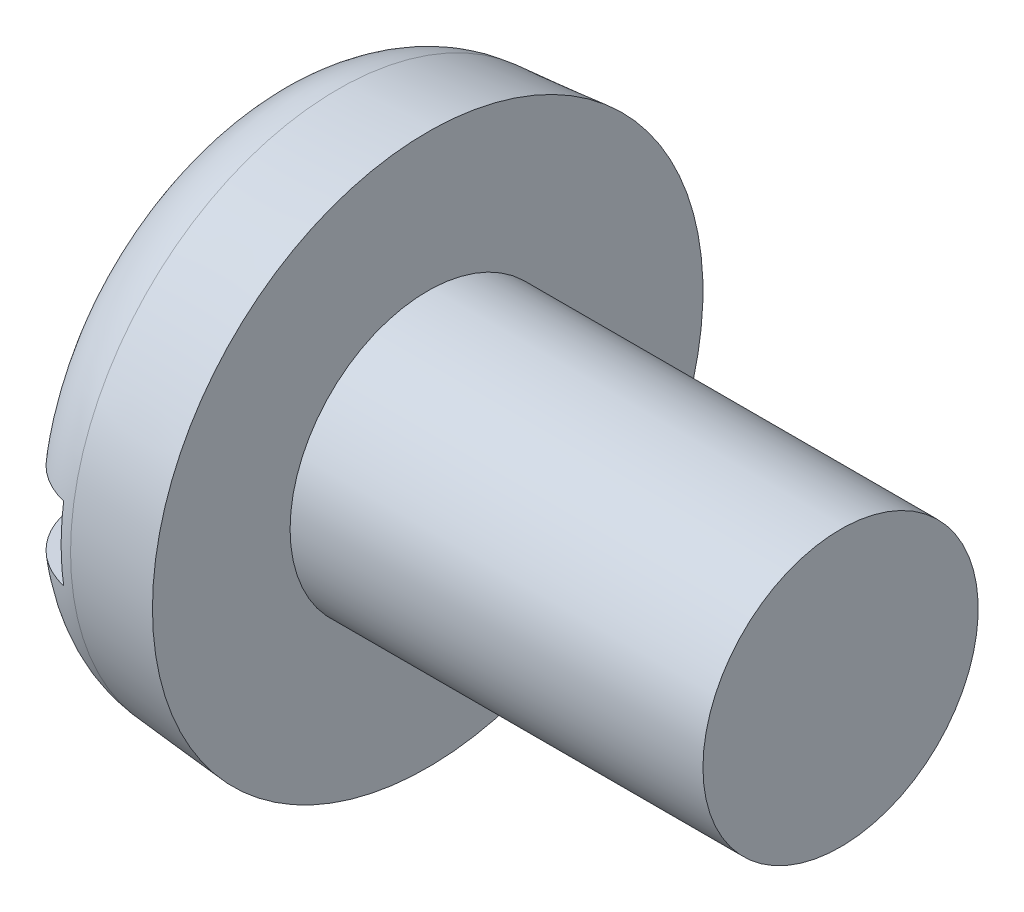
ISO-10303-21;
HEADER;
FILE_DESCRIPTION(('STEP AP214'),'2;1');
FILE_NAME('part.step','',(''),(''),'','','');
FILE_SCHEMA(('AUTOMOTIVE_DESIGN { 1 0 10303 214 1 1 1 1 }'));
ENDSEC;
DATA;
#1=APPLICATION_CONTEXT('core data for automotive mechanical design processes');
#2=APPLICATION_PROTOCOL_DEFINITION('international standard','automotive_design',2000,#1);
#3=PRODUCT_CONTEXT('',#1,'mechanical');
#4=PRODUCT('Part','Part','',(#3));
#5=PRODUCT_RELATED_PRODUCT_CATEGORY('part','',(#4));
#6=PRODUCT_DEFINITION_FORMATION('','',#4);
#7=PRODUCT_DEFINITION_CONTEXT('part definition',#1,'design');
#8=PRODUCT_DEFINITION('design','',#6,#7);
#9=PRODUCT_DEFINITION_SHAPE('','',#8);
#10=(LENGTH_UNIT() NAMED_UNIT(*) SI_UNIT(.MILLI.,.METRE.));
#11=(NAMED_UNIT(*) PLANE_ANGLE_UNIT() SI_UNIT($,.RADIAN.));
#12=(NAMED_UNIT(*) SI_UNIT($,.STERADIAN.) SOLID_ANGLE_UNIT());
#13=UNCERTAINTY_MEASURE_WITH_UNIT(LENGTH_MEASURE(1.E-05),#10,'distance_accuracy_value','');
#14=(GEOMETRIC_REPRESENTATION_CONTEXT(3) GLOBAL_UNCERTAINTY_ASSIGNED_CONTEXT((#13)) GLOBAL_UNIT_ASSIGNED_CONTEXT((#10,
#11,#12)) REPRESENTATION_CONTEXT('',''));
#15=CARTESIAN_POINT('',(0.,0.,0.));
#16=DIRECTION('',(0.,0.,1.));
#17=DIRECTION('',(1.,0.,0.));
#18=AXIS2_PLACEMENT_3D('',#15,#16,#17);
#19=CARTESIAN_POINT('',(0.,0.,0.));
#20=DIRECTION('',(-1.,0.,0.));
#21=DIRECTION('',(0.,0.,1.));
#22=AXIS2_PLACEMENT_3D('',#19,#20,#21);
#23=PLANE('',#22);
#24=DIRECTION('',(0.,0.,-1.));
#25=VECTOR('',#24,1.);
#26=CARTESIAN_POINT('',(0.,0.799999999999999,6.));
#27=LINE('',#26,#25);
#28=CARTESIAN_POINT('',(0.,0.799999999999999,3.9555566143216));
#29=VERTEX_POINT('',#28);
#30=CARTESIAN_POINT('',(0.,0.799999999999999,-3.9555566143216));
#31=VERTEX_POINT('',#30);
#32=EDGE_CURVE('E85',#29,#31,#27,.T.);
#33=ORIENTED_EDGE('',*,*,#32,.F.);
#34=CARTESIAN_POINT('',(0.,0.,0.));
#35=DIRECTION('',(-1.,0.,0.));
#36=DIRECTION('',(0.,0.,1.));
#37=AXIS2_PLACEMENT_3D('',#34,#35,#36);
#38=CIRCLE('',#37,4.03564469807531);
#39=EDGE_CURVE('E91',#29,#31,#38,.T.);
#40=ORIENTED_EDGE('',*,*,#39,.T.);
#41=EDGE_LOOP('',(#33,#40));
#42=FACE_BOUND('',#41,.T.);
#43=ADVANCED_FACE('F32',(#42),#23,.T.);
#44=CARTESIAN_POINT('',(-25.4,0.,0.));
#45=DIRECTION('',(-1.,0.,0.));
#46=DIRECTION('',(0.,0.,1.));
#47=AXIS2_PLACEMENT_3D('',#44,#45,#46);
#48=CYLINDRICAL_SURFACE('',#47,3.);
#49=CARTESIAN_POINT('',(12.6,0.,0.));
#50=DIRECTION('',(-1.,0.,0.));
#51=DIRECTION('',(0.,0.,1.));
#52=AXIS2_PLACEMENT_3D('',#49,#50,#51);
#53=CIRCLE('',#52,3.);
#54=CARTESIAN_POINT('',(12.6,0.,3.));
#55=VERTEX_POINT('',#54);
#56=EDGE_CURVE('E92',#55,#55,#53,.T.);
#57=ORIENTED_EDGE('',*,*,#56,.T.);
#58=EDGE_LOOP('',(#57));
#59=FACE_BOUND('',#58,.T.);
#60=CARTESIAN_POINT('',(3.6,0.,0.));
#61=DIRECTION('',(-1.,0.,0.));
#62=DIRECTION('',(0.,0.,1.));
#63=AXIS2_PLACEMENT_3D('',#60,#61,#62);
#64=CIRCLE('',#63,3.);
#65=CARTESIAN_POINT('',(3.6,0.,3.));
#66=VERTEX_POINT('',#65);
#67=EDGE_CURVE('E149',#66,#66,#64,.T.);
#68=ORIENTED_EDGE('',*,*,#67,.F.);
#69=EDGE_LOOP('',(#68));
#70=FACE_BOUND('',#69,.T.);
#71=ADVANCED_FACE('F137',(#59,#70),#48,.T.);
#72=CARTESIAN_POINT('',(12.6,3.,0.));
#73=DIRECTION('',(1.,0.,0.));
#74=DIRECTION('',(0.,0.,-1.));
#75=AXIS2_PLACEMENT_3D('',#72,#73,#74);
#76=PLANE('',#75);
#77=ORIENTED_EDGE('',*,*,#56,.F.);
#78=EDGE_LOOP('',(#77));
#79=FACE_BOUND('',#78,.T.);
#80=ADVANCED_FACE('F135',(#79),#76,.T.);
#81=DIRECTION('',(0.,0.,1.));
#82=VECTOR('',#81,1.);
#83=CARTESIAN_POINT('',(0.,-0.799999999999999,-6.));
#84=LINE('',#83,#82);
#85=CARTESIAN_POINT('',(0.,-0.799999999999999,-3.9555566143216));
#86=VERTEX_POINT('',#85);
#87=CARTESIAN_POINT('',(0.,-0.800000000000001,3.9555566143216));
#88=VERTEX_POINT('',#87);
#89=EDGE_CURVE('E76',#86,#88,#84,.T.);
#90=ORIENTED_EDGE('',*,*,#89,.F.);
#91=EDGE_CURVE('E83',#86,#88,#38,.T.);
#92=ORIENTED_EDGE('',*,*,#91,.T.);
#93=EDGE_LOOP('',(#90,#92));
#94=FACE_BOUND('',#93,.T.);
#95=ADVANCED_FACE('F82',(#94),#23,.T.);
#96=CARTESIAN_POINT('',(0.,0.,0.));
#97=DIRECTION('',(1.,0.,0.));
#98=DIRECTION('',(0.,0.,-1.));
#99=AXIS2_PLACEMENT_3D('',#96,#97,#98);
#100=CONICAL_SURFACE('',#99,5.68504081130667,0.0872664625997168);
#101=CARTESIAN_POINT('',(1.64311966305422,0.,0.));
#102=DIRECTION('',(-1.,0.,0.));
#103=DIRECTION('',(0.,0.,1.));
#104=AXIS2_PLACEMENT_3D('',#101,#102,#103);
#105=CIRCLE('',#104,5.82879515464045);
#106=CARTESIAN_POINT('',(1.64311966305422,0.,5.82879515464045));
#107=VERTEX_POINT('',#106);
#108=EDGE_CURVE('E95',#107,#107,#105,.F.);
#109=ORIENTED_EDGE('',*,*,#108,.T.);
#110=EDGE_LOOP('',(#109));
#111=FACE_BOUND('',#110,.T.);
#112=CARTESIAN_POINT('',(3.6,0.,0.));
#113=DIRECTION('',(-1.,0.,0.));
#114=DIRECTION('',(0.,0.,1.));
#115=AXIS2_PLACEMENT_3D('',#112,#113,#114);
#116=CIRCLE('',#115,6.);
#117=CARTESIAN_POINT('',(3.6,0.,6.));
#118=VERTEX_POINT('',#117);
#119=EDGE_CURVE('E97',#118,#118,#116,.T.);
#120=ORIENTED_EDGE('',*,*,#119,.T.);
#121=EDGE_LOOP('',(#120));
#122=FACE_BOUND('',#121,.T.);
#123=ADVANCED_FACE('F128',(#111,#122),#100,.T.);
#124=CARTESIAN_POINT('',(3.6,3.,0.));
#125=DIRECTION('',(-1.,0.,0.));
#126=DIRECTION('',(0.,0.,1.));
#127=AXIS2_PLACEMENT_3D('',#124,#125,#126);
#128=PLANE('',#127);
#129=ORIENTED_EDGE('',*,*,#119,.F.);
#130=EDGE_LOOP('',(#129));
#131=FACE_BOUND('',#130,.T.);
#132=ORIENTED_EDGE('',*,*,#67,.T.);
#133=EDGE_LOOP('',(#132));
#134=FACE_BOUND('',#133,.T.);
#135=ADVANCED_FACE('F124',(#131,#134),#128,.F.);
#136=CARTESIAN_POINT('',(1.8,0.,0.));
#137=DIRECTION('',(-1.,0.,0.));
#138=DIRECTION('',(0.,0.,1.));
#139=AXIS2_PLACEMENT_3D('',#136,#137,#138);
#140=TOROIDAL_SURFACE('',#139,4.03564469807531,1.8);
#141=CARTESIAN_POINT('',(0.540762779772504,0.799999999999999,-5.2613759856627));
#142=CARTESIAN_POINT('',(0.612348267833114,0.799999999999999,-5.33226007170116));
#143=CARTESIAN_POINT('',(0.689931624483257,0.799999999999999,-5.3971854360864));
#144=CARTESIAN_POINT('',(0.854947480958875,0.799999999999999,-5.51316161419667));
#145=CARTESIAN_POINT('',(0.94239068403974,0.799999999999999,-5.56419714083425));
#146=CARTESIAN_POINT('',(1.12461220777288,0.799999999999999,-5.650821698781));
#147=CARTESIAN_POINT('',(1.21938917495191,0.799999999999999,-5.6864135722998));
#148=CARTESIAN_POINT('',(1.41356630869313,0.799999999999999,-5.74109194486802));
#149=CARTESIAN_POINT('',(1.51296538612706,0.799999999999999,-5.76018231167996));
#150=CARTESIAN_POINT('',(1.71313899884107,0.799999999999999,-5.78126121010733));
#151=CARTESIAN_POINT('',(1.81390602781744,0.799999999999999,-5.78332104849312));
#152=CARTESIAN_POINT('',(2.01435310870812,0.799999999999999,-5.77046455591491));
#153=CARTESIAN_POINT('',(2.11403314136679,0.799999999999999,-5.75554792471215));
#154=CARTESIAN_POINT('',(2.309314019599,0.799999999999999,-5.70921606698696));
#155=CARTESIAN_POINT('',(2.40492104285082,0.799999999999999,-5.67782686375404));
#156=CARTESIAN_POINT('',(2.58952927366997,0.799999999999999,-5.59948776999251));
#157=CARTESIAN_POINT('',(2.67853045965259,0.799999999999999,-5.55253782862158));
#158=CARTESIAN_POINT('',(2.84769451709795,0.799999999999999,-5.44428887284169));
#159=CARTESIAN_POINT('',(2.92783091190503,0.799999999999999,-5.38294849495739));
#160=CARTESIAN_POINT('',(3.07676159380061,0.799999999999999,-5.24777626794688));
#161=CARTESIAN_POINT('',(3.1455556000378,0.799999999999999,-5.17394410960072));
#162=CARTESIAN_POINT('',(3.27042510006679,0.799999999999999,-5.01531035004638));
#163=CARTESIAN_POINT('',(3.32640120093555,0.799999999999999,-4.93043053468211));
#164=CARTESIAN_POINT('',(3.4235057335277,0.799999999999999,-4.75256933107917));
#165=CARTESIAN_POINT('',(3.46463341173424,0.799999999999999,-4.65958753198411));
#166=CARTESIAN_POINT('',(3.53144158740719,0.799999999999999,-4.46694835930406));
#167=CARTESIAN_POINT('',(3.55692557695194,0.799999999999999,-4.36722286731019));
#168=CARTESIAN_POINT('',(3.59108701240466,0.799999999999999,-4.16493761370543));
#169=CARTESIAN_POINT('',(3.59976314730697,0.799999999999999,-4.06237763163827));
#170=CARTESIAN_POINT('',(3.60023112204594,0.799999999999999,-3.85550711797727));
#171=CARTESIAN_POINT('',(3.59173848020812,0.799999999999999,-3.75119596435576));
#172=CARTESIAN_POINT('',(3.55768438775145,0.799999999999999,-3.54539907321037));
#173=CARTESIAN_POINT('',(3.53212117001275,0.799999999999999,-3.44391362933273));
#174=CARTESIAN_POINT('',(3.46412322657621,0.799999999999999,-3.24471369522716));
#175=CARTESIAN_POINT('',(3.42139292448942,0.799999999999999,-3.14710004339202));
#176=CARTESIAN_POINT('',(3.32030286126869,0.799999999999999,-2.96031799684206));
#177=CARTESIAN_POINT('',(3.26194098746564,0.799999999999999,-2.87115074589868));
#178=CARTESIAN_POINT('',(3.13053846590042,0.799999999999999,-2.70303664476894));
#179=CARTESIAN_POINT('',(3.05736818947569,0.799999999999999,-2.62419095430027));
#180=CARTESIAN_POINT('',(2.89859048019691,0.799999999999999,-2.48017518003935));
#181=CARTESIAN_POINT('',(2.81298317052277,0.799999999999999,-2.41500496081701));
#182=CARTESIAN_POINT('',(2.6334271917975,0.799999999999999,-2.30187272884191));
#183=CARTESIAN_POINT('',(2.53967929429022,0.799999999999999,-2.25359299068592));
#184=CARTESIAN_POINT('',(2.34507363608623,0.799999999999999,-2.17455467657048));
#185=CARTESIAN_POINT('',(2.24421969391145,0.799999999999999,-2.14378676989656));
#186=CARTESIAN_POINT('',(2.04443930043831,0.799999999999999,-2.10254396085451));
#187=CARTESIAN_POINT('',(1.94573097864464,0.799999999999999,-2.09101175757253));
#188=CARTESIAN_POINT('',(1.74783816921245,0.799999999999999,-2.08550669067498));
#189=CARTESIAN_POINT('',(1.64865381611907,0.799999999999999,-2.09152912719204));
#190=CARTESIAN_POINT('',(1.45702700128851,0.799999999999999,-2.12018138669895));
#191=CARTESIAN_POINT('',(1.36447664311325,0.799999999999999,-2.14209986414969));
#192=CARTESIAN_POINT('',(1.18420660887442,0.799999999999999,-2.20075771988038));
#193=CARTESIAN_POINT('',(1.09648771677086,0.799999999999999,-2.23749949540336));
#194=CARTESIAN_POINT('',(0.925723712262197,0.799999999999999,-2.32557805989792));
#195=CARTESIAN_POINT('',(0.842868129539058,0.799999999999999,-2.37728131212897));
#196=CARTESIAN_POINT('',(0.686362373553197,0.799999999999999,-2.493116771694));
#197=CARTESIAN_POINT('',(0.612714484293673,0.799999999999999,-2.55725205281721));
#198=CARTESIAN_POINT('',(0.472161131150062,0.799999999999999,-2.70027682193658));
#199=CARTESIAN_POINT('',(0.405916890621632,0.799999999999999,-2.77981681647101));
#200=CARTESIAN_POINT('',(0.287173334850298,0.799999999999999,-2.9485732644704));
#201=CARTESIAN_POINT('',(0.234676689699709,0.799999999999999,-3.03779159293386));
#202=CARTESIAN_POINT('',(0.143214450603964,0.799999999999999,-3.22677844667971));
#203=CARTESIAN_POINT('',(0.104782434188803,0.799999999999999,-3.32680584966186));
#204=CARTESIAN_POINT('',(0.0452446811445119,0.799999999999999,-3.5318922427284));
#205=CARTESIAN_POINT('',(0.0241387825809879,0.799999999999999,-3.63695118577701));
#206=CARTESIAN_POINT('',(-1.12670491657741E-05,0.799999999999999,-3.84916824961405));
#207=CARTESIAN_POINT('',(-0.00304965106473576,0.799999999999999,-3.95632702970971));
#208=CARTESIAN_POINT('',(0.00921984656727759,0.799999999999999,-4.16962319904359));
#209=CARTESIAN_POINT('',(0.0245310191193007,0.799999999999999,-4.27576040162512));
#210=CARTESIAN_POINT('',(0.0728327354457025,0.799999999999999,-4.48216521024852));
#211=CARTESIAN_POINT('',(0.105541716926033,0.799999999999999,-4.58249883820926));
#212=CARTESIAN_POINT('',(0.187634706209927,0.799999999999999,-4.77599767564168));
#213=CARTESIAN_POINT('',(0.236996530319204,0.799999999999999,-4.86917222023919));
#214=CARTESIAN_POINT('',(0.329466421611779,0.799999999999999,-5.01228034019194));
#215=CARTESIAN_POINT('',(0.367921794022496,0.799999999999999,-5.06527765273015));
#216=CARTESIAN_POINT('',(0.450329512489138,0.799999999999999,-5.16681267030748));
#217=CARTESIAN_POINT('',(0.494281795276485,0.799999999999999,-5.21535042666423));
#218=CARTESIAN_POINT('',(0.540762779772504,0.799999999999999,-5.2613759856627));
#219=B_SPLINE_CURVE_WITH_KNOTS('',3,(#141,#142,#143,#144,#145,#146,#147,#148,#149,#150,#151,
#152,#153,#154,#155,#156,#157,#158,#159,#160,#161,#162,#163,#164,#165,#166,#167,#168,#169,#170,
#171,#172,#173,#174,#175,#176,#177,#178,#179,#180,#181,#182,#183,#184,#185,#186,#187,#188,#189,
#190,#191,#192,#193,#194,#195,#196,#197,#198,#199,#200,#201,#202,#203,#204,#205,#206,#207,#208,
#209,#210,#211,#212,#213,#214,#215,#216,#217,#218),.UNSPECIFIED.,.T.,.F.,(4,2,2,2,2,2,2,2,2,2,2,
2,2,2,2,2,2,2,2,2,2,2,2,2,2,2,2,2,2,2,2,2,2,2,2,2,2,2,4),(0.,0.301990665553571,
0.604312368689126,0.906578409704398,1.20877358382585,1.50970282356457,1.81063738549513,
2.11109795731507,2.41155951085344,2.71289551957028,3.01423898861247,3.31784547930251,
3.6214673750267,3.92882908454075,4.23621476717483,4.54873547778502,4.86128854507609,
5.17947093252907,5.49769634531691,5.81883829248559,6.13997705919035,6.45470120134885,
6.76925749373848,7.06587349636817,7.36241009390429,7.64643650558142,7.93050886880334,
8.22223277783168,8.51402890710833,8.8231740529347,9.13237919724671,9.45232886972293,
9.77227555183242,10.0923243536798,10.4124305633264,10.7275071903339,11.042165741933,
11.2382527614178,11.4343375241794),.UNSPECIFIED.);
#220=CARTESIAN_POINT('',(1.4,0.799999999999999,-5.73510972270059));
#221=VERTEX_POINT('',#220);
#222=EDGE_CURVE('E11',#31,#221,#219,.T.);
#223=ORIENTED_EDGE('',*,*,#222,.F.);
#224=ORIENTED_EDGE('',*,*,#39,.F.);
#225=CARTESIAN_POINT('',(0.836266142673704,0.799999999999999,2.3847675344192));
#226=CARTESIAN_POINT('',(0.917616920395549,0.799999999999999,2.33037611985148));
#227=CARTESIAN_POINT('',(1.00338812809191,0.799999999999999,2.28250940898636));
#228=CARTESIAN_POINT('',(1.18171371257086,0.799999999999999,2.20157945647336));
#229=CARTESIAN_POINT('',(1.27427138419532,0.799999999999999,2.16852346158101));
#230=CARTESIAN_POINT('',(1.46387360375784,0.799999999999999,2.11861651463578));
#231=CARTESIAN_POINT('',(1.56092620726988,0.799999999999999,2.10179593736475));
#232=CARTESIAN_POINT('',(1.75645828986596,0.799999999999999,2.08531619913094));
#233=CARTESIAN_POINT('',(1.85493729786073,0.799999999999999,2.08565149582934));
#234=CARTESIAN_POINT('',(2.04724581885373,0.799999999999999,2.10316628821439));
#235=CARTESIAN_POINT('',(2.1411242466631,0.799999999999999,2.11981673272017));
#236=CARTESIAN_POINT('',(2.32483197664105,0.799999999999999,2.16840533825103));
#237=CARTESIAN_POINT('',(2.41466058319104,0.799999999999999,2.20034611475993));
#238=CARTESIAN_POINT('',(2.58937479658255,0.799999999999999,2.27883470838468));
#239=CARTESIAN_POINT('',(2.67416016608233,0.799999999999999,2.32560484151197));
#240=CARTESIAN_POINT('',(2.83527159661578,0.799999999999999,2.43194790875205));
#241=CARTESIAN_POINT('',(2.91159566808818,0.799999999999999,2.4915238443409));
#242=CARTESIAN_POINT('',(3.05833847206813,0.799999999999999,2.62557742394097));
#243=CARTESIAN_POINT('',(3.12814463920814,0.799999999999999,2.70072607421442));
#244=CARTESIAN_POINT('',(3.25476371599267,0.799999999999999,2.86127427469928));
#245=CARTESIAN_POINT('',(3.31157384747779,0.799999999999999,2.94667601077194));
#246=CARTESIAN_POINT('',(3.41282909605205,0.799999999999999,3.12914373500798));
#247=CARTESIAN_POINT('',(3.4566732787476,0.799999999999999,3.22654397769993));
#248=CARTESIAN_POINT('',(3.52749042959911,0.799999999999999,3.42730182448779));
#249=CARTESIAN_POINT('',(3.55446245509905,0.799999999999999,3.53065976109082));
#250=CARTESIAN_POINT('',(3.59074777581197,0.799999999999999,3.74099682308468));
#251=CARTESIAN_POINT('',(3.59996828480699,0.799999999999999,3.84799201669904));
#252=CARTESIAN_POINT('',(3.60003154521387,0.799999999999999,4.06199242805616));
#253=CARTESIAN_POINT('',(3.59087543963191,0.799999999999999,4.16899764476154));
#254=CARTESIAN_POINT('',(3.5545508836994,0.799999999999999,4.37828946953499));
#255=CARTESIAN_POINT('',(3.5276490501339,0.799999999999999,4.48062230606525));
#256=CARTESIAN_POINT('',(3.45672417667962,0.799999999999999,4.67917518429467));
#257=CARTESIAN_POINT('',(3.41270279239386,0.799999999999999,4.77539581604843));
#258=CARTESIAN_POINT('',(3.30967441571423,0.799999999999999,4.95711293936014));
#259=CARTESIAN_POINT('',(3.2509575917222,0.799999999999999,5.04277397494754));
#260=CARTESIAN_POINT('',(3.11977209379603,0.799999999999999,5.20282644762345));
#261=CARTESIAN_POINT('',(3.04730458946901,0.799999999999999,5.27721884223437));
#262=CARTESIAN_POINT('',(2.89186263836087,0.799999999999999,5.41145672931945));
#263=CARTESIAN_POINT('',(2.80906226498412,0.799999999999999,5.47150384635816));
#264=CARTESIAN_POINT('',(2.63447307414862,0.799999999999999,5.57667826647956));
#265=CARTESIAN_POINT('',(2.54268479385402,0.799999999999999,5.62180646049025));
#266=CARTESIAN_POINT('',(2.35372245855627,0.799999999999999,5.69541178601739));
#267=CARTESIAN_POINT('',(2.25661170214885,0.799999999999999,5.72405148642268));
#268=CARTESIAN_POINT('',(2.05894963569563,0.799999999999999,5.76452632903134));
#269=CARTESIAN_POINT('',(1.95839844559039,0.799999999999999,5.77636205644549));
#270=CARTESIAN_POINT('',(1.75726466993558,0.799999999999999,5.78286013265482));
#271=CARTESIAN_POINT('',(1.65668492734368,0.799999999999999,5.77761084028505));
#272=CARTESIAN_POINT('',(1.45783846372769,0.799999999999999,5.75028865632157));
#273=CARTESIAN_POINT('',(1.35957171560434,0.799999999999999,5.72821596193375));
#274=CARTESIAN_POINT('',(1.16819371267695,0.799999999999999,5.66791633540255));
#275=CARTESIAN_POINT('',(1.07507939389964,0.799999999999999,5.62969912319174));
#276=CARTESIAN_POINT('',(0.896555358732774,0.799999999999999,5.53823241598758));
#277=CARTESIAN_POINT('',(0.811145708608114,0.799999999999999,5.4849827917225));
#278=CARTESIAN_POINT('',(0.650082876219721,0.799999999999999,5.36476593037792));
#279=CARTESIAN_POINT('',(0.574468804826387,0.799999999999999,5.29774630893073));
#280=CARTESIAN_POINT('',(0.435451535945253,0.799999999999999,5.15205983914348));
#281=CARTESIAN_POINT('',(0.372048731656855,0.799999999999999,5.07339261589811));
#282=CARTESIAN_POINT('',(0.258650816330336,0.799999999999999,4.90594446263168));
#283=CARTESIAN_POINT('',(0.208774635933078,0.799999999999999,4.81708301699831));
#284=CARTESIAN_POINT('',(0.124428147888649,0.799999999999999,4.63233098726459));
#285=CARTESIAN_POINT('',(0.0899587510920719,0.799999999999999,4.53643998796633));
#286=CARTESIAN_POINT('',(0.0368868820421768,0.799999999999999,4.33899079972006));
#287=CARTESIAN_POINT('',(0.0185025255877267,0.799999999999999,4.23737401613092));
#288=CARTESIAN_POINT('',(-0.00125734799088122,0.799999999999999,4.03250747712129));
#289=CARTESIAN_POINT('',(-0.00263209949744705,0.799999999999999,3.9292576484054));
#290=CARTESIAN_POINT('',(0.0116307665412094,0.799999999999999,3.72214563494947));
#291=CARTESIAN_POINT('',(0.0275632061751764,0.799999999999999,3.61830377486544));
#292=CARTESIAN_POINT('',(0.0763335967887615,0.799999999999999,3.41464106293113));
#293=CARTESIAN_POINT('',(0.10917724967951,0.799999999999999,3.31482157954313));
#294=CARTESIAN_POINT('',(0.191511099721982,0.799999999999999,3.12021092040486));
#295=CARTESIAN_POINT('',(0.241286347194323,0.799999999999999,3.02554040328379));
#296=CARTESIAN_POINT('',(0.355915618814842,0.799999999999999,2.8458978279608));
#297=CARTESIAN_POINT('',(0.420755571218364,0.799999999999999,2.76091682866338));
#298=CARTESIAN_POINT('',(0.543269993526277,0.799999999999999,2.62572980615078));
#299=CARTESIAN_POINT('',(0.597683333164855,0.799999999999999,2.57253239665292));
#300=CARTESIAN_POINT('',(0.712598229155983,0.799999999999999,2.4731680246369));
#301=CARTESIAN_POINT('',(0.773099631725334,0.799999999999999,2.42700088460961));
#302=CARTESIAN_POINT('',(0.836266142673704,0.799999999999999,2.3847675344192));
#303=B_SPLINE_CURVE_WITH_KNOTS('',3,(#225,#226,#227,#228,#229,#230,#231,#232,#233,#234,#235,
#236,#237,#238,#239,#240,#241,#242,#243,#244,#245,#246,#247,#248,#249,#250,#251,#252,#253,#254,
#255,#256,#257,#258,#259,#260,#261,#262,#263,#264,#265,#266,#267,#268,#269,#270,#271,#272,#273,
#274,#275,#276,#277,#278,#279,#280,#281,#282,#283,#284,#285,#286,#287,#288,#289,#290,#291,#292,
#293,#294,#295,#296,#297,#298,#299,#300,#301,#302),.UNSPECIFIED.,.T.,.F.,(4,2,2,2,2,2,2,2,2,2,2,
2,2,2,2,2,2,2,2,2,2,2,2,2,2,2,2,2,2,2,2,2,2,2,2,2,2,2,4),(0.,0.293321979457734,
0.586787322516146,0.880800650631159,1.17471899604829,1.45941156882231,1.74415285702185,
2.03338255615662,2.32268012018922,2.62901646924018,2.93541824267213,3.25435495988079,
3.57330949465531,3.89392670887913,4.21452398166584,4.53041098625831,4.84626744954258,
5.1563211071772,5.46634840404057,5.77172128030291,6.0770759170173,6.37936593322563,
6.6816454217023,6.98236409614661,7.2830792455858,7.5836136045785,7.88415054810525,
8.18585270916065,8.48756458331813,8.79184901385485,9.09615143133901,9.40451898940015,
9.71290042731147,10.0266186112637,10.3404426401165,10.6598354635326,10.9789311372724,
11.2066928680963,11.43444884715),.UNSPECIFIED.);
#304=CARTESIAN_POINT('',(1.4,0.799999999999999,5.73510972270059));
#305=VERTEX_POINT('',#304);
#306=EDGE_CURVE('E109',#305,#29,#303,.T.);
#307=ORIENTED_EDGE('',*,*,#306,.F.);
#308=CARTESIAN_POINT('',(1.4,0.,0.));
#309=DIRECTION('',(-1.,0.,0.));
#310=DIRECTION('',(0.,0.,1.));
#311=AXIS2_PLACEMENT_3D('',#308,#309,#310);
#312=CIRCLE('',#311,5.79063757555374);
#313=CARTESIAN_POINT('',(1.4,-0.800000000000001,5.73510972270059));
#314=VERTEX_POINT('',#313);
#315=EDGE_CURVE('E103',#305,#314,#312,.F.);
#316=ORIENTED_EDGE('',*,*,#315,.T.);
#317=CARTESIAN_POINT('',(0.836266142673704,-0.8,2.3847675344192));
#318=CARTESIAN_POINT('',(0.748506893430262,-0.8,2.44345191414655));
#319=CARTESIAN_POINT('',(0.665766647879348,-0.8,2.50981960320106));
#320=CARTESIAN_POINT('',(0.512551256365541,-0.8,2.65561376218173));
#321=CARTESIAN_POINT('',(0.442099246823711,-0.8,2.73506432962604));
#322=CARTESIAN_POINT('',(0.315475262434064,-0.8,2.90443495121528));
#323=CARTESIAN_POINT('',(0.259280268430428,-0.8,2.99433778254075));
#324=CARTESIAN_POINT('',(0.162548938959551,-0.8,3.18215299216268));
#325=CARTESIAN_POINT('',(0.122006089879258,-0.8,3.28006201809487));
#326=CARTESIAN_POINT('',(0.0572425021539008,-0.8,3.4827212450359));
#327=CARTESIAN_POINT('',(0.0332676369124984,-0.8,3.58755021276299));
#328=CARTESIAN_POINT('',(0.00342578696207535,-0.8,3.79976969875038));
#329=CARTESIAN_POINT('',(-0.00244009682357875,-0.800000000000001,3.90716037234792));
#330=CARTESIAN_POINT('',(0.00425089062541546,-0.800000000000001,4.12040369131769));
#331=CARTESIAN_POINT('',(0.0166422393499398,-0.800000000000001,4.22626147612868));
#332=CARTESIAN_POINT('',(0.0593599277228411,-0.800000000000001,4.43429705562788));
#333=CARTESIAN_POINT('',(0.0896844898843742,-0.800000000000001,4.53647521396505));
#334=CARTESIAN_POINT('',(0.166811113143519,-0.800000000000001,4.73226366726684));
#335=CARTESIAN_POINT('',(0.21330327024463,-0.800000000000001,4.82599604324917));
#336=CARTESIAN_POINT('',(0.32162267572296,-0.800000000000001,5.00413844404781));
#337=CARTESIAN_POINT('',(0.383448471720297,-0.800000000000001,5.08854935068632));
#338=CARTESIAN_POINT('',(0.519544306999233,-0.800000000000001,5.24416143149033));
#339=CARTESIAN_POINT('',(0.593588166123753,-0.800000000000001,5.31556046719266));
#340=CARTESIAN_POINT('',(0.752739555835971,-0.800000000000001,5.44472836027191));
#341=CARTESIAN_POINT('',(0.837846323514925,-0.800000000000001,5.5024981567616));
#342=CARTESIAN_POINT('',(1.01558854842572,-0.800000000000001,5.60205300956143));
#343=CARTESIAN_POINT('',(1.10812041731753,-0.800000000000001,5.64402306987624));
#344=CARTESIAN_POINT('',(1.29895009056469,-0.800000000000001,5.71170590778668));
#345=CARTESIAN_POINT('',(1.39724763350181,-0.800000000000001,5.7374194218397));
#346=CARTESIAN_POINT('',(1.59606633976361,-0.800000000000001,5.77169733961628));
#347=CARTESIAN_POINT('',(1.69656671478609,-0.800000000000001,5.78038241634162));
#348=CARTESIAN_POINT('',(1.89759433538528,-0.800000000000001,5.78071120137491));
#349=CARTESIAN_POINT('',(1.99812158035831,-0.800000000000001,5.77235526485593));
#350=CARTESIAN_POINT('',(2.19609344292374,-0.800000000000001,5.73889133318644));
#351=CARTESIAN_POINT('',(2.29354498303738,-0.800000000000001,5.71382425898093));
#352=CARTESIAN_POINT('',(2.48286854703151,-0.800000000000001,5.64771711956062));
#353=CARTESIAN_POINT('',(2.57474056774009,-0.800000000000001,5.60667704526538));
#354=CARTESIAN_POINT('',(2.75051258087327,-0.800000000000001,5.50972539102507));
#355=CARTESIAN_POINT('',(2.8343959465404,-0.800000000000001,5.45378367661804));
#356=CARTESIAN_POINT('',(2.99165678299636,-0.800000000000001,5.32869697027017));
#357=CARTESIAN_POINT('',(3.06503402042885,-0.800000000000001,5.25955168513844));
#358=CARTESIAN_POINT('',(3.19973989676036,-0.800000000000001,5.10955333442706));
#359=CARTESIAN_POINT('',(3.26098586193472,-0.800000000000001,5.02862604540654));
#360=CARTESIAN_POINT('',(3.36919753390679,-0.800000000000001,4.85773374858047));
#361=CARTESIAN_POINT('',(3.41616259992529,-0.800000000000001,4.76776833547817));
#362=CARTESIAN_POINT('',(3.49507738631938,-0.800000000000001,4.5802716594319));
#363=CARTESIAN_POINT('',(3.52685014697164,-0.800000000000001,4.48266594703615));
#364=CARTESIAN_POINT('',(3.57383908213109,-0.800000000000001,4.28355151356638));
#365=CARTESIAN_POINT('',(3.58905405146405,-0.800000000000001,4.18204250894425));
#366=CARTESIAN_POINT('',(3.60277332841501,-0.800000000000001,3.97627512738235));
#367=CARTESIAN_POINT('',(3.60100695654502,-0.8,3.87199872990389));
#368=CARTESIAN_POINT('',(3.58032198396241,-0.8,3.66516328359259));
#369=CARTESIAN_POINT('',(3.56140169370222,-0.8,3.56260440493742));
#370=CARTESIAN_POINT('',(3.50655445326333,-0.8,3.3601262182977));
#371=CARTESIAN_POINT('',(3.47032341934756,-0.8,3.26028924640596));
#372=CARTESIAN_POINT('',(3.38182060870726,-0.8,3.06798854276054));
#373=CARTESIAN_POINT('',(3.32954675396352,-0.8,2.97552576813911));
#374=CARTESIAN_POINT('',(3.20964725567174,-0.8,2.79948120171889));
#375=CARTESIAN_POINT('',(3.14184223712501,-0.8,2.71602141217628));
#376=CARTESIAN_POINT('',(2.99302219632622,-0.8,2.56181483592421));
#377=CARTESIAN_POINT('',(2.91200632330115,-0.8,2.49106886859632));
#378=CARTESIAN_POINT('',(2.73997760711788,-0.8,2.36551639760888));
#379=CARTESIAN_POINT('',(2.64910309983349,-0.8,2.31052086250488));
#380=CARTESIAN_POINT('',(2.4590409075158,-0.8,2.21753014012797));
#381=CARTESIAN_POINT('',(2.35985743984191,-0.8,2.17952638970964));
#382=CARTESIAN_POINT('',(2.16147923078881,-0.8,2.12383562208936));
#383=CARTESIAN_POINT('',(2.06255196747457,-0.8,2.10519696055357));
#384=CARTESIAN_POINT('',(1.86294330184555,-0.8,2.08580594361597));
#385=CARTESIAN_POINT('',(1.76226208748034,-0.8,2.08505168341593));
#386=CARTESIAN_POINT('',(1.56749167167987,-0.8,2.1010369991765));
#387=CARTESIAN_POINT('',(1.47332742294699,-0.8,2.11688981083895));
#388=CARTESIAN_POINT('',(1.28901868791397,-0.8,2.16397488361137));
#389=CARTESIAN_POINT('',(1.19886974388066,-0.8,2.19518960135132));
#390=CARTESIAN_POINT('',(1.0638315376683,-0.8,2.25452352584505));
#391=CARTESIAN_POINT('',(1.01673933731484,-0.8,2.27777851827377));
#392=CARTESIAN_POINT('',(0.924773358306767,-0.8,2.32831196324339));
#393=CARTESIAN_POINT('',(0.879899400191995,-0.8,2.35559008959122));
#394=CARTESIAN_POINT('',(0.836266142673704,-0.8,2.3847675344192));
#395=B_SPLINE_CURVE_WITH_KNOTS('',3,(#317,#318,#319,#320,#321,#322,#323,#324,#325,#326,#327,
#328,#329,#330,#331,#332,#333,#334,#335,#336,#337,#338,#339,#340,#341,#342,#343,#344,#345,#346,
#347,#348,#349,#350,#351,#352,#353,#354,#355,#356,#357,#358,#359,#360,#361,#362,#363,#364,#365,
#366,#367,#368,#369,#370,#371,#372,#373,#374,#375,#376,#377,#378,#379,#380,#381,#382,#383,#384,
#385,#386,#387,#388,#389,#390,#391,#392,#393,#394),.UNSPECIFIED.,.T.,.F.,(4,2,2,2,2,2,2,2,2,2,2,
2,2,2,2,2,2,2,2,2,2,2,2,2,2,2,2,2,2,2,2,2,2,2,2,2,2,2,4),(0.,0.316518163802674,
0.633625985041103,0.950218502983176,1.2666791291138,1.58774070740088,1.90882180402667,
2.22700979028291,2.54516624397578,2.8575328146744,3.16986980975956,3.47696670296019,
3.78404242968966,4.08740155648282,4.39074693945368,4.69193476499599,4.99311631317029,
5.29356304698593,5.59400995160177,5.89506910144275,6.19613493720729,6.49918680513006,
6.80225226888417,7.10876667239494,7.41530338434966,7.72673423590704,8.03819576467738,
8.35534173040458,8.6725287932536,8.99358246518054,9.31465682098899,9.63169865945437,
9.94858054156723,10.2490245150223,10.549436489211,10.8345871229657,11.1194128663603,
11.276796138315,11.4341666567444),.UNSPECIFIED.);
#396=EDGE_CURVE('E90',#88,#314,#395,.T.);
#397=ORIENTED_EDGE('',*,*,#396,.F.);
#398=ORIENTED_EDGE('',*,*,#91,.F.);
#399=CARTESIAN_POINT('',(0.540762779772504,-0.799999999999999,-5.2613759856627));
#400=CARTESIAN_POINT('',(0.46800256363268,-0.799999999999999,-5.18931554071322));
#401=CARTESIAN_POINT('',(0.401331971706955,-0.799999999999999,-5.11098969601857));
#402=CARTESIAN_POINT('',(0.282092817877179,-0.799999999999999,-4.94415021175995));
#403=CARTESIAN_POINT('',(0.229543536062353,-0.799999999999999,-4.85562287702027));
#404=CARTESIAN_POINT('',(0.140058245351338,-0.799999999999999,-4.67111833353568));
#405=CARTESIAN_POINT('',(0.103104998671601,-0.799999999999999,-4.57514948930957));
#406=CARTESIAN_POINT('',(0.0456444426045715,-0.799999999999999,-4.37844736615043));
#407=CARTESIAN_POINT('',(0.0251330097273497,-0.799999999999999,-4.27771528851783));
#408=CARTESIAN_POINT('',(0.000807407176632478,-0.799999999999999,-4.07306902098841));
#409=CARTESIAN_POINT('',(-0.00280970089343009,-0.799999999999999,-3.96913144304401));
#410=CARTESIAN_POINT('',(0.00712688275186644,-0.799999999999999,-3.76207815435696));
#411=CARTESIAN_POINT('',(0.0206829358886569,-0.8,-3.65896255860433));
#412=CARTESIAN_POINT('',(0.0648595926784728,-0.8,-3.45448287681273));
#413=CARTESIAN_POINT('',(0.0957869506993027,-0.8,-3.35318504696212));
#414=CARTESIAN_POINT('',(0.173966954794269,-0.8,-3.15709227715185));
#415=CARTESIAN_POINT('',(0.221221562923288,-0.8,-3.06229812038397));
#416=CARTESIAN_POINT('',(0.331523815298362,-0.8,-2.8805427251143));
#417=CARTESIAN_POINT('',(0.394784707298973,-0.8,-2.79371074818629));
#418=CARTESIAN_POINT('',(0.535080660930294,-0.8,-2.63196239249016));
#419=CARTESIAN_POINT('',(0.612117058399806,-0.8,-2.5570471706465));
#420=CARTESIAN_POINT('',(0.777363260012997,-0.8,-2.42207446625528));
#421=CARTESIAN_POINT('',(0.865488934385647,-0.8,-2.36191424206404));
#422=CARTESIAN_POINT('',(1.05097305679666,-0.8,-2.25807126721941));
#423=CARTESIAN_POINT('',(1.1483280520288,-0.8,-2.21438238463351));
#424=CARTESIAN_POINT('',(1.34472607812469,-0.8,-2.14709500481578));
#425=CARTESIAN_POINT('',(1.44348146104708,-0.8,-2.12265879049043));
#426=CARTESIAN_POINT('',(1.64375523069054,-0.8,-2.09184121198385));
#427=CARTESIAN_POINT('',(1.74527230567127,-0.8,-2.08545142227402));
#428=CARTESIAN_POINT('',(1.94205144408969,-0.8,-2.09089422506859));
#429=CARTESIAN_POINT('',(2.03734311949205,-0.8,-2.1017185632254));
#430=CARTESIAN_POINT('',(2.22475371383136,-0.8,-2.1391955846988));
#431=CARTESIAN_POINT('',(2.31687240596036,-0.8,-2.16584939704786));
#432=CARTESIAN_POINT('',(2.49568716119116,-0.8,-2.23389898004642));
#433=CARTESIAN_POINT('',(2.58237134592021,-0.8,-2.27532580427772));
#434=CARTESIAN_POINT('',(2.74807422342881,-0.8,-2.37138684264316));
#435=CARTESIAN_POINT('',(2.82709115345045,-0.8,-2.42602408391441));
#436=CARTESIAN_POINT('',(2.9799165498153,-0.8,-2.55022645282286));
#437=CARTESIAN_POINT('',(3.05318434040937,-0.8,-2.6204569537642));
#438=CARTESIAN_POINT('',(3.18755425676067,-0.8,-2.77172635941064));
#439=CARTESIAN_POINT('',(3.24865355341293,-0.8,-2.85276777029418));
#440=CARTESIAN_POINT('',(3.35979277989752,-0.8,-3.02754470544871));
#441=CARTESIAN_POINT('',(3.40917690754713,-0.8,-3.1216981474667));
#442=CARTESIAN_POINT('',(3.49164209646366,-0.8,-3.31689856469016));
#443=CARTESIAN_POINT('',(3.52472176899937,-0.8,-3.41794612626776));
#444=CARTESIAN_POINT('',(3.57383047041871,-0.8,-3.62528781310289));
#445=CARTESIAN_POINT('',(3.58966846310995,-0.8,-3.73162733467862));
#446=CARTESIAN_POINT('',(3.60302482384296,-0.8,-3.94545563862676));
#447=CARTESIAN_POINT('',(3.60054405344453,-0.799999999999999,-4.05294436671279));
#448=CARTESIAN_POINT('',(3.57730809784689,-0.799999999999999,-4.26456838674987));
#449=CARTESIAN_POINT('',(3.5567824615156,-0.799999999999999,-4.36872882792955));
#450=CARTESIAN_POINT('',(3.49820144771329,-0.799999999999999,-4.57200098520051));
#451=CARTESIAN_POINT('',(3.46014775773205,-0.799999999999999,-4.67111318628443));
#452=CARTESIAN_POINT('',(3.36835841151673,-0.799999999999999,-4.85952398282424));
#453=CARTESIAN_POINT('',(3.31492535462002,-0.799999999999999,-4.94897001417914));
#454=CARTESIAN_POINT('',(3.19357222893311,-0.799999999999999,-5.1174283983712));
#455=CARTESIAN_POINT('',(3.12565341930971,-0.799999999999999,-5.196441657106));
#456=CARTESIAN_POINT('',(2.97843308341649,-0.799999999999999,-5.34047951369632));
#457=CARTESIAN_POINT('',(2.89932889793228,-0.799999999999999,-5.40570586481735));
#458=CARTESIAN_POINT('',(2.73119091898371,-0.799999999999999,-5.52177624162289));
#459=CARTESIAN_POINT('',(2.64215774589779,-0.799999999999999,-5.57262116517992));
#460=CARTESIAN_POINT('',(2.45774484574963,-0.799999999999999,-5.65792437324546));
#461=CARTESIAN_POINT('',(2.36244515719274,-0.799999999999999,-5.69255575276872));
#462=CARTESIAN_POINT('',(2.16736859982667,-0.799999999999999,-5.7452167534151));
#463=CARTESIAN_POINT('',(2.06759209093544,-0.799999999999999,-5.76324770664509));
#464=CARTESIAN_POINT('',(1.8670464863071,-0.799999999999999,-5.78211504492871));
#465=CARTESIAN_POINT('',(1.76628722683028,-0.799999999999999,-5.78305617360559));
#466=CARTESIAN_POINT('',(1.56601778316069,-0.799999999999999,-5.76798048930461));
#467=CARTESIAN_POINT('',(1.46650790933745,-0.799999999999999,-5.75195954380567));
#468=CARTESIAN_POINT('',(1.27169371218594,-0.799999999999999,-5.70345798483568));
#469=CARTESIAN_POINT('',(1.17638560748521,-0.799999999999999,-5.67099251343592));
#470=CARTESIAN_POINT('',(0.992639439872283,-0.799999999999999,-5.59058259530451));
#471=CARTESIAN_POINT('',(0.904192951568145,-0.799999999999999,-5.54265751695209));
#472=CARTESIAN_POINT('',(0.770167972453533,-0.799999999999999,-5.45480755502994));
#473=CARTESIAN_POINT('',(0.72159797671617,-0.799999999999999,-5.41935523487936));
#474=CARTESIAN_POINT('',(0.628240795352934,-0.799999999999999,-5.34377955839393));
#475=CARTESIAN_POINT('',(0.583453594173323,-0.799999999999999,-5.30365622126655));
#476=CARTESIAN_POINT('',(0.540762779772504,-0.799999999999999,-5.2613759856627));
#477=B_SPLINE_CURVE_WITH_KNOTS('',3,(#399,#400,#401,#402,#403,#404,#405,#406,#407,#408,#409,
#410,#411,#412,#413,#414,#415,#416,#417,#418,#419,#420,#421,#422,#423,#424,#425,#426,#427,#428,
#429,#430,#431,#432,#433,#434,#435,#436,#437,#438,#439,#440,#441,#442,#443,#444,#445,#446,#447,
#448,#449,#450,#451,#452,#453,#454,#455,#456,#457,#458,#459,#460,#461,#462,#463,#464,#465,#466,
#467,#468,#469,#470,#471,#472,#473,#474,#475,#476),.UNSPECIFIED.,.T.,.F.,(4,2,2,2,2,2,2,2,2,2,2,
2,2,2,2,2,2,2,2,2,2,2,2,2,2,2,2,2,2,2,2,2,2,2,2,2,2,2,4),(0.,0.306991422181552,0.61439988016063,
0.921467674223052,1.22845843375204,1.53902124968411,1.84962677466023,2.1658978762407,
2.48220699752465,2.80297521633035,3.12377455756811,3.4422723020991,3.76065135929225,
4.06426589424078,4.36773865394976,4.65408102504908,4.94044382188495,5.22741215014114,
5.51444629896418,5.81757894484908,6.12078198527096,6.43825439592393,6.75575384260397,
7.07673643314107,7.39770392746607,7.71464653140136,8.03155862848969,8.34261788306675,
8.65365010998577,8.95975564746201,9.2658420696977,9.56858170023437,9.87129703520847,
10.1721563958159,10.4730890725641,10.7737451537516,11.0740260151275,11.254148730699,
11.4342707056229),.UNSPECIFIED.);
#478=CARTESIAN_POINT('',(1.4,-0.799999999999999,-5.73510972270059));
#479=VERTEX_POINT('',#478);
#480=EDGE_CURVE('E44',#479,#86,#477,.T.);
#481=ORIENTED_EDGE('',*,*,#480,.F.);
#482=EDGE_CURVE('E56',#479,#221,#312,.F.);
#483=ORIENTED_EDGE('',*,*,#482,.T.);
#484=EDGE_LOOP('',(#223,#224,#307,#316,#397,#398,#481,#483));
#485=FACE_BOUND('',#484,.T.);
#486=ORIENTED_EDGE('',*,*,#108,.F.);
#487=EDGE_LOOP('',(#486));
#488=FACE_BOUND('',#487,.T.);
#489=ADVANCED_FACE('F34',(#485,#488),#140,.T.);
#490=CARTESIAN_POINT('',(1.4,0.799999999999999,6.));
#491=DIRECTION('',(0.,1.,0.));
#492=DIRECTION('',(0.,0.,1.));
#493=AXIS2_PLACEMENT_3D('',#490,#491,#492);
#494=PLANE('',#493);
#495=ORIENTED_EDGE('',*,*,#222,.T.);
#496=DIRECTION('',(0.,0.,-1.));
#497=VECTOR('',#496,1.);
#498=CARTESIAN_POINT('',(1.4,0.799999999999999,6.));
#499=LINE('',#498,#497);
#500=EDGE_CURVE('E84',#305,#221,#499,.T.);
#501=ORIENTED_EDGE('',*,*,#500,.F.);
#502=ORIENTED_EDGE('',*,*,#306,.T.);
#503=ORIENTED_EDGE('',*,*,#32,.T.);
#504=EDGE_LOOP('',(#495,#501,#502,#503));
#505=FACE_BOUND('',#504,.T.);
#506=ADVANCED_FACE('F116',(#505),#494,.F.);
#507=CARTESIAN_POINT('',(1.4,-0.799999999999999,-6.));
#508=DIRECTION('',(0.,-1.,0.));
#509=DIRECTION('',(0.,0.,-1.));
#510=AXIS2_PLACEMENT_3D('',#507,#508,#509);
#511=PLANE('',#510);
#512=ORIENTED_EDGE('',*,*,#480,.T.);
#513=ORIENTED_EDGE('',*,*,#89,.T.);
#514=ORIENTED_EDGE('',*,*,#396,.T.);
#515=DIRECTION('',(0.,0.,1.));
#516=VECTOR('',#515,1.);
#517=CARTESIAN_POINT('',(1.4,-0.799999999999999,-6.));
#518=LINE('',#517,#516);
#519=EDGE_CURVE('E51',#479,#314,#518,.T.);
#520=ORIENTED_EDGE('',*,*,#519,.F.);
#521=EDGE_LOOP('',(#512,#513,#514,#520));
#522=FACE_BOUND('',#521,.T.);
#523=ADVANCED_FACE('F75',(#522),#511,.F.);
#524=CARTESIAN_POINT('',(1.4,0.799999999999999,-6.));
#525=DIRECTION('',(-1.,0.,0.));
#526=DIRECTION('',(0.,0.,1.));
#527=AXIS2_PLACEMENT_3D('',#524,#525,#526);
#528=PLANE('',#527);
#529=ORIENTED_EDGE('',*,*,#519,.T.);
#530=ORIENTED_EDGE('',*,*,#315,.F.);
#531=ORIENTED_EDGE('',*,*,#500,.T.);
#532=ORIENTED_EDGE('',*,*,#482,.F.);
#533=EDGE_LOOP('',(#529,#530,#531,#532));
#534=FACE_BOUND('',#533,.T.);
#535=ADVANCED_FACE('F115',(#534),#528,.T.);
#536=CLOSED_SHELL('',(#43,#71,#80,#95,#123,#135,#489,#506,#523,#535));
#537=MANIFOLD_SOLID_BREP('B2',#536);
#538=ADVANCED_BREP_SHAPE_REPRESENTATION('',(#18,#537),#14);
#539=SHAPE_DEFINITION_REPRESENTATION(#9,#538);
ENDSEC;
END-ISO-10303-21;
